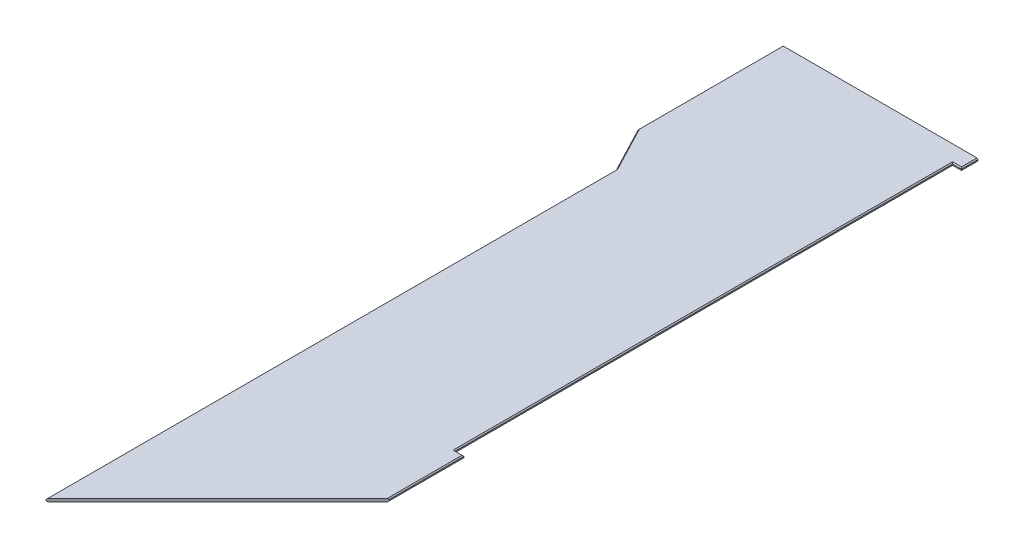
ISO-10303-21;
HEADER;
FILE_DESCRIPTION(('STEP AP214'),'2;1');
FILE_NAME('part.step','',(''),(''),'','','');
FILE_SCHEMA(('AUTOMOTIVE_DESIGN { 1 0 10303 214 1 1 1 1 }'));
ENDSEC;
DATA;
#1=APPLICATION_CONTEXT('core data for automotive mechanical design processes');
#2=APPLICATION_PROTOCOL_DEFINITION('international standard','automotive_design',2000,#1);
#3=PRODUCT_CONTEXT('',#1,'mechanical');
#4=PRODUCT('Part','Part','',(#3));
#5=PRODUCT_RELATED_PRODUCT_CATEGORY('part','',(#4));
#6=PRODUCT_DEFINITION_FORMATION('','',#4);
#7=PRODUCT_DEFINITION_CONTEXT('part definition',#1,'design');
#8=PRODUCT_DEFINITION('design','',#6,#7);
#9=PRODUCT_DEFINITION_SHAPE('','',#8);
#10=(LENGTH_UNIT() NAMED_UNIT(*) SI_UNIT(.MILLI.,.METRE.));
#11=(NAMED_UNIT(*) PLANE_ANGLE_UNIT() SI_UNIT($,.RADIAN.));
#12=(NAMED_UNIT(*) SI_UNIT($,.STERADIAN.) SOLID_ANGLE_UNIT());
#13=UNCERTAINTY_MEASURE_WITH_UNIT(LENGTH_MEASURE(1.E-05),#10,'distance_accuracy_value','');
#14=(GEOMETRIC_REPRESENTATION_CONTEXT(3) GLOBAL_UNCERTAINTY_ASSIGNED_CONTEXT((#13)) GLOBAL_UNIT_ASSIGNED_CONTEXT((#10,
#11,#12)) REPRESENTATION_CONTEXT('',''));
#15=CARTESIAN_POINT('',(0.,0.,0.));
#16=DIRECTION('',(0.,0.,1.));
#17=DIRECTION('',(1.,0.,0.));
#18=AXIS2_PLACEMENT_3D('',#15,#16,#17);
#19=CARTESIAN_POINT('',(552.551731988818,9.525,994.453846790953));
#20=DIRECTION('',(0.,0.,1.));
#21=DIRECTION('',(1.,0.,0.));
#22=AXIS2_PLACEMENT_3D('',#19,#20,#21);
#23=PLANE('',#22);
#24=DIRECTION('',(0.,-1.,0.));
#25=VECTOR('',#24,1.);
#26=CARTESIAN_POINT('',(552.551731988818,9.525,994.453846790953));
#27=LINE('',#26,#25);
#28=CARTESIAN_POINT('',(552.551731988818,3.52500000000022,994.453846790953));
#29=VERTEX_POINT('',#28);
#30=CARTESIAN_POINT('',(552.551731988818,-3.52500000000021,994.453846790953));
#31=VERTEX_POINT('',#30);
#32=EDGE_CURVE('E391',#29,#31,#27,.T.);
#33=ORIENTED_EDGE('',*,*,#32,.T.);
#34=DIRECTION('',(-1.,0.,0.));
#35=VECTOR('',#34,1.);
#36=CARTESIAN_POINT('',(498.751731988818,-3.52500000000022,994.453846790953));
#37=LINE('',#36,#35);
#38=CARTESIAN_POINT('',(498.751731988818,-3.52500000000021,994.453846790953));
#39=VERTEX_POINT('',#38);
#40=EDGE_CURVE('E327',#31,#39,#37,.T.);
#41=ORIENTED_EDGE('',*,*,#40,.T.);
#42=DIRECTION('',(0.,-1.,0.));
#43=VECTOR('',#42,1.);
#44=CARTESIAN_POINT('',(498.751731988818,9.525,994.453846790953));
#45=LINE('',#44,#43);
#46=CARTESIAN_POINT('',(498.751731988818,3.52500000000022,994.453846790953));
#47=VERTEX_POINT('',#46);
#48=EDGE_CURVE('E218',#47,#39,#45,.T.);
#49=ORIENTED_EDGE('',*,*,#48,.F.);
#50=DIRECTION('',(1.,0.,0.));
#51=VECTOR('',#50,1.);
#52=CARTESIAN_POINT('',(552.551731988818,3.52500000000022,994.453846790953));
#53=LINE('',#52,#51);
#54=EDGE_CURVE('E73',#47,#29,#53,.T.);
#55=ORIENTED_EDGE('',*,*,#54,.T.);
#56=EDGE_LOOP('',(#33,#41,#49,#55));
#57=FACE_BOUND('',#56,.T.);
#58=ADVANCED_FACE('F50',(#57),#23,.F.);
#59=CARTESIAN_POINT('',(498.751731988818,9.525,994.453846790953));
#60=DIRECTION('',(-1.,0.,0.));
#61=DIRECTION('',(0.,0.,1.));
#62=AXIS2_PLACEMENT_3D('',#59,#60,#61);
#63=PLANE('',#62);
#64=ORIENTED_EDGE('',*,*,#48,.T.);
#65=DIRECTION('',(0.,0.,-1.));
#66=VECTOR('',#65,1.);
#67=CARTESIAN_POINT('',(498.751731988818,-3.52500000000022,-2017.54615320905));
#68=LINE('',#67,#66);
#69=CARTESIAN_POINT('',(498.751731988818,-3.52500000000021,-2017.54615320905));
#70=VERTEX_POINT('',#69);
#71=EDGE_CURVE('E323',#39,#70,#68,.T.);
#72=ORIENTED_EDGE('',*,*,#71,.T.);
#73=DIRECTION('',(0.,-1.,0.));
#74=VECTOR('',#73,1.);
#75=CARTESIAN_POINT('',(498.751731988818,9.525,-2017.54615320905));
#76=LINE('',#75,#74);
#77=CARTESIAN_POINT('',(498.751731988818,3.52500000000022,-2017.54615320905));
#78=VERTEX_POINT('',#77);
#79=EDGE_CURVE('E228',#78,#70,#76,.T.);
#80=ORIENTED_EDGE('',*,*,#79,.F.);
#81=DIRECTION('',(0.,0.,1.));
#82=VECTOR('',#81,1.);
#83=CARTESIAN_POINT('',(498.751731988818,3.52500000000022,994.453846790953));
#84=LINE('',#83,#82);
#85=EDGE_CURVE('E325',#78,#47,#84,.T.);
#86=ORIENTED_EDGE('',*,*,#85,.T.);
#87=EDGE_LOOP('',(#64,#72,#80,#86));
#88=FACE_BOUND('',#87,.T.);
#89=ADVANCED_FACE('F461',(#88),#63,.F.);
#90=CARTESIAN_POINT('',(498.751731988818,9.525,-2017.54615320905));
#91=DIRECTION('',(0.,0.,-1.));
#92=DIRECTION('',(-1.,0.,0.));
#93=AXIS2_PLACEMENT_3D('',#90,#91,#92);
#94=PLANE('',#93);
#95=ORIENTED_EDGE('',*,*,#79,.T.);
#96=DIRECTION('',(1.,0.,0.));
#97=VECTOR('',#96,1.);
#98=CARTESIAN_POINT('',(552.551731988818,-3.52500000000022,-2017.54615320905));
#99=LINE('',#98,#97);
#100=CARTESIAN_POINT('',(552.551731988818,-3.52500000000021,-2017.54615320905));
#101=VERTEX_POINT('',#100);
#102=EDGE_CURVE('E316',#70,#101,#99,.T.);
#103=ORIENTED_EDGE('',*,*,#102,.T.);
#104=DIRECTION('',(0.,-1.,0.));
#105=VECTOR('',#104,1.);
#106=CARTESIAN_POINT('',(552.551731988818,9.525,-2017.54615320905));
#107=LINE('',#106,#105);
#108=CARTESIAN_POINT('',(552.551731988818,3.52500000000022,-2017.54615320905));
#109=VERTEX_POINT('',#108);
#110=EDGE_CURVE('E412',#109,#101,#107,.T.);
#111=ORIENTED_EDGE('',*,*,#110,.F.);
#112=DIRECTION('',(-1.,0.,0.));
#113=VECTOR('',#112,1.);
#114=CARTESIAN_POINT('',(498.751731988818,3.52500000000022,-2017.54615320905));
#115=LINE('',#114,#113);
#116=EDGE_CURVE('E317',#109,#78,#115,.T.);
#117=ORIENTED_EDGE('',*,*,#116,.T.);
#118=EDGE_LOOP('',(#95,#103,#111,#117));
#119=FACE_BOUND('',#118,.T.);
#120=ADVANCED_FACE('F421',(#119),#94,.F.);
#121=CARTESIAN_POINT('',(552.551731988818,9.525,-2017.54615320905));
#122=DIRECTION('',(-1.,0.,0.));
#123=DIRECTION('',(0.,0.,1.));
#124=AXIS2_PLACEMENT_3D('',#121,#122,#123);
#125=PLANE('',#124);
#126=ORIENTED_EDGE('',*,*,#110,.T.);
#127=DIRECTION('',(0.,0.,-1.));
#128=VECTOR('',#127,1.);
#129=CARTESIAN_POINT('',(552.551731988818,-3.52500000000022,-2117.54615320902));
#130=LINE('',#129,#128);
#131=CARTESIAN_POINT('',(552.551731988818,-3.52500000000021,-2117.54615320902));
#132=VERTEX_POINT('',#131);
#133=EDGE_CURVE('E315',#101,#132,#130,.T.);
#134=ORIENTED_EDGE('',*,*,#133,.T.);
#135=DIRECTION('',(0.,-1.,0.));
#136=VECTOR('',#135,1.);
#137=CARTESIAN_POINT('',(552.551731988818,9.525,-2117.54615320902));
#138=LINE('',#137,#136);
#139=CARTESIAN_POINT('',(552.551731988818,3.52500000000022,-2117.54615320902));
#140=VERTEX_POINT('',#139);
#141=EDGE_CURVE('E414',#140,#132,#138,.T.);
#142=ORIENTED_EDGE('',*,*,#141,.F.);
#143=DIRECTION('',(0.,0.,1.));
#144=VECTOR('',#143,1.);
#145=CARTESIAN_POINT('',(552.551731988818,3.52500000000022,-2017.54615320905));
#146=LINE('',#145,#144);
#147=EDGE_CURVE('E307',#140,#109,#146,.T.);
#148=ORIENTED_EDGE('',*,*,#147,.T.);
#149=EDGE_LOOP('',(#126,#134,#142,#148));
#150=FACE_BOUND('',#149,.T.);
#151=ADVANCED_FACE('F445',(#150),#125,.F.);
#152=CARTESIAN_POINT('',(552.551731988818,9.525,-2117.54615320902));
#153=DIRECTION('',(0.,0.,1.));
#154=DIRECTION('',(1.,0.,0.));
#155=AXIS2_PLACEMENT_3D('',#152,#153,#154);
#156=PLANE('',#155);
#157=DIRECTION('',(-1.,0.,0.));
#158=VECTOR('',#157,1.);
#159=CARTESIAN_POINT('',(552.551731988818,-9.525,-2117.54615320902));
#160=LINE('',#159,#158);
#161=CARTESIAN_POINT('',(546.551731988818,-9.525,-2117.54615320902));
#162=VERTEX_POINT('',#161);
#163=CARTESIAN_POINT('',(-626.248268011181,-9.525,-2117.54615320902));
#164=VERTEX_POINT('',#163);
#165=EDGE_CURVE('E341',#162,#164,#160,.T.);
#166=ORIENTED_EDGE('',*,*,#165,.T.);
#167=DIRECTION('',(-0.707106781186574,0.707106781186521,0.));
#168=VECTOR('',#167,1.);
#169=CARTESIAN_POINT('',(-632.248268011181,-3.52500000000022,-2117.54615320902));
#170=LINE('',#169,#168);
#171=CARTESIAN_POINT('',(-632.248268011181,-3.52500000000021,-2117.54615320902));
#172=VERTEX_POINT('',#171);
#173=EDGE_CURVE('E284',#164,#172,#170,.T.);
#174=ORIENTED_EDGE('',*,*,#173,.T.);
#175=DIRECTION('',(0.,-1.,0.));
#176=VECTOR('',#175,1.);
#177=CARTESIAN_POINT('',(-632.248268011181,9.525,-2117.54615320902));
#178=LINE('',#177,#176);
#179=CARTESIAN_POINT('',(-632.248268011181,3.52500000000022,-2117.54615320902));
#180=VERTEX_POINT('',#179);
#181=EDGE_CURVE('E410',#180,#172,#178,.T.);
#182=ORIENTED_EDGE('',*,*,#181,.F.);
#183=DIRECTION('',(-0.707106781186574,-0.707106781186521,0.));
#184=VECTOR('',#183,1.);
#185=CARTESIAN_POINT('',(-626.248268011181,9.525,-2117.54615320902));
#186=LINE('',#185,#184);
#187=CARTESIAN_POINT('',(-626.248268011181,9.525,-2117.54615320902));
#188=VERTEX_POINT('',#187);
#189=EDGE_CURVE('E279',#180,#188,#186,.F.);
#190=ORIENTED_EDGE('',*,*,#189,.T.);
#191=DIRECTION('',(-1.,0.,0.));
#192=VECTOR('',#191,1.);
#193=CARTESIAN_POINT('',(552.551731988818,9.525,-2117.54615320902));
#194=LINE('',#193,#192);
#195=CARTESIAN_POINT('',(546.551731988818,9.525,-2117.54615320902));
#196=VERTEX_POINT('',#195);
#197=EDGE_CURVE('E448',#196,#188,#194,.T.);
#198=ORIENTED_EDGE('',*,*,#197,.F.);
#199=DIRECTION('',(-0.707106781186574,0.707106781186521,0.));
#200=VECTOR('',#199,1.);
#201=CARTESIAN_POINT('',(546.551731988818,9.525,-2117.54615320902));
#202=LINE('',#201,#200);
#203=EDGE_CURVE('E275',#196,#140,#202,.F.);
#204=ORIENTED_EDGE('',*,*,#203,.T.);
#205=ORIENTED_EDGE('',*,*,#141,.T.);
#206=DIRECTION('',(-0.707106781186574,-0.707106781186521,0.));
#207=VECTOR('',#206,1.);
#208=CARTESIAN_POINT('',(552.551731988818,-3.52500000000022,-2117.54615320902));
#209=LINE('',#208,#207);
#210=EDGE_CURVE('E273',#132,#162,#209,.T.);
#211=ORIENTED_EDGE('',*,*,#210,.T.);
#212=EDGE_LOOP('',(#166,#174,#182,#190,#198,#204,#205,#211));
#213=FACE_BOUND('',#212,.T.);
#214=ADVANCED_FACE('F447',(#213),#156,.F.);
#215=CARTESIAN_POINT('',(-632.248268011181,9.525,-2117.54615320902));
#216=DIRECTION('',(1.,0.,0.));
#217=DIRECTION('',(0.,0.,-1.));
#218=AXIS2_PLACEMENT_3D('',#215,#216,#217);
#219=PLANE('',#218);
#220=ORIENTED_EDGE('',*,*,#181,.T.);
#221=DIRECTION('',(0.,0.,1.));
#222=VECTOR('',#221,1.);
#223=CARTESIAN_POINT('',(-632.248268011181,-3.52500000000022,-1245.01955496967));
#224=LINE('',#223,#222);
#225=CARTESIAN_POINT('',(-632.248268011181,-3.52500000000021,-1245.01955496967));
#226=VERTEX_POINT('',#225);
#227=EDGE_CURVE('E269',#172,#226,#224,.T.);
#228=ORIENTED_EDGE('',*,*,#227,.T.);
#229=DIRECTION('',(0.,-1.,0.));
#230=VECTOR('',#229,1.);
#231=CARTESIAN_POINT('',(-632.248268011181,9.525,-1245.01955496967));
#232=LINE('',#231,#230);
#233=CARTESIAN_POINT('',(-632.248268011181,3.52500000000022,-1245.01955496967));
#234=VERTEX_POINT('',#233);
#235=EDGE_CURVE('E401',#234,#226,#232,.T.);
#236=ORIENTED_EDGE('',*,*,#235,.F.);
#237=DIRECTION('',(0.,0.,-1.));
#238=VECTOR('',#237,1.);
#239=CARTESIAN_POINT('',(-632.248268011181,3.52500000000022,-2117.54615320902));
#240=LINE('',#239,#238);
#241=EDGE_CURVE('E268',#234,#180,#240,.T.);
#242=ORIENTED_EDGE('',*,*,#241,.T.);
#243=EDGE_LOOP('',(#220,#228,#236,#242));
#244=FACE_BOUND('',#243,.T.);
#245=ADVANCED_FACE('F690',(#244),#219,.F.);
#246=CARTESIAN_POINT('',(-487.06076801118,9.525,-967.229254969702));
#247=DIRECTION('',(0.886253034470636,0.,-0.463201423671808));
#248=DIRECTION('',(-0.463201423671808,0.,-0.886253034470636));
#249=AXIS2_PLACEMENT_3D('',#246,#247,#248);
#250=PLANE('',#249);
#251=ORIENTED_EDGE('',*,*,#235,.T.);
#252=DIRECTION('',(0.463201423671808,0.,0.886253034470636));
#253=VECTOR('',#252,1.);
#254=CARTESIAN_POINT('',(-487.06076801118,-3.52500000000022,-967.229254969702));
#255=LINE('',#254,#253);
#256=CARTESIAN_POINT('',(-487.06076801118,-3.52500000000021,-967.229254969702));
#257=VERTEX_POINT('',#256);
#258=EDGE_CURVE('E265',#226,#257,#255,.T.);
#259=ORIENTED_EDGE('',*,*,#258,.T.);
#260=DIRECTION('',(0.,-1.,0.));
#261=VECTOR('',#260,1.);
#262=CARTESIAN_POINT('',(-487.06076801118,9.525,-967.229254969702));
#263=LINE('',#262,#261);
#264=CARTESIAN_POINT('',(-487.06076801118,3.52500000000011,-967.229254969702));
#265=VERTEX_POINT('',#264);
#266=EDGE_CURVE('E212',#265,#257,#263,.T.);
#267=ORIENTED_EDGE('',*,*,#266,.F.);
#268=DIRECTION('',(-0.463201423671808,0.,-0.886253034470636));
#269=VECTOR('',#268,1.);
#270=CARTESIAN_POINT('',(-487.06076801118,3.52500000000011,-967.229254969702));
#271=LINE('',#270,#269);
#272=EDGE_CURVE('E258',#265,#234,#271,.T.);
#273=ORIENTED_EDGE('',*,*,#272,.T.);
#274=EDGE_LOOP('',(#251,#259,#267,#273));
#275=FACE_BOUND('',#274,.T.);
#276=ADVANCED_FACE('F679',(#275),#250,.F.);
#277=CARTESIAN_POINT('',(-487.06076801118,9.525,2485.26634679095));
#278=DIRECTION('',(1.,0.,0.));
#279=DIRECTION('',(0.,0.,-1.));
#280=AXIS2_PLACEMENT_3D('',#277,#278,#279);
#281=PLANE('',#280);
#282=ORIENTED_EDGE('',*,*,#266,.T.);
#283=DIRECTION('',(0.,0.,1.));
#284=VECTOR('',#283,1.);
#285=CARTESIAN_POINT('',(-487.06076801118,-3.52500000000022,2485.26634679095));
#286=LINE('',#285,#284);
#287=CARTESIAN_POINT('',(-487.06076801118,-3.52500000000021,2485.26634679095));
#288=VERTEX_POINT('',#287);
#289=EDGE_CURVE('E209',#257,#288,#286,.T.);
#290=ORIENTED_EDGE('',*,*,#289,.T.);
#291=DIRECTION('',(0.,-1.,0.));
#292=VECTOR('',#291,1.);
#293=CARTESIAN_POINT('',(-487.06076801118,9.525,2485.26634679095));
#294=LINE('',#293,#292);
#295=CARTESIAN_POINT('',(-487.06076801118,3.52500000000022,2485.26634679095));
#296=VERTEX_POINT('',#295);
#297=EDGE_CURVE('E192',#296,#288,#294,.T.);
#298=ORIENTED_EDGE('',*,*,#297,.F.);
#299=DIRECTION('',(0.,0.,-1.));
#300=VECTOR('',#299,1.);
#301=CARTESIAN_POINT('',(-487.06076801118,3.52500000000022,2485.26634679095));
#302=LINE('',#301,#300);
#303=EDGE_CURVE('E207',#296,#265,#302,.T.);
#304=ORIENTED_EDGE('',*,*,#303,.T.);
#305=EDGE_LOOP('',(#282,#290,#298,#304));
#306=FACE_BOUND('',#305,.T.);
#307=ADVANCED_FACE('F202',(#306),#281,.F.);
#308=CARTESIAN_POINT('',(552.551731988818,9.525,1445.65384679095));
#309=DIRECTION('',(-0.707106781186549,0.,-0.707106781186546));
#310=DIRECTION('',(-0.707106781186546,0.,0.707106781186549));
#311=AXIS2_PLACEMENT_3D('',#308,#309,#310);
#312=PLANE('',#311);
#313=ORIENTED_EDGE('',*,*,#297,.T.);
#314=DIRECTION('',(0.577350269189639,-0.577350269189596,-0.577350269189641));
#315=VECTOR('',#314,1.);
#316=CARTESIAN_POINT('',(-487.060768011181,-3.52500000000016,2485.26634679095));
#317=LINE('',#316,#315);
#318=CARTESIAN_POINT('',(-481.06076801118,-9.525,2479.26634679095));
#319=VERTEX_POINT('',#318);
#320=EDGE_CURVE('E198',#288,#319,#317,.T.);
#321=ORIENTED_EDGE('',*,*,#320,.T.);
#322=DIRECTION('',(0.707106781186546,0.,-0.707106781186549));
#323=VECTOR('',#322,1.);
#324=CARTESIAN_POINT('',(552.551731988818,-9.525,1445.65384679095));
#325=LINE('',#324,#323);
#326=CARTESIAN_POINT('',(546.551731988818,-9.525,1451.65384679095));
#327=VERTEX_POINT('',#326);
#328=EDGE_CURVE('E765',#319,#327,#325,.T.);
#329=ORIENTED_EDGE('',*,*,#328,.T.);
#330=DIRECTION('',(0.577350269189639,0.577350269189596,-0.577350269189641));
#331=VECTOR('',#330,1.);
#332=CARTESIAN_POINT('',(552.551731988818,-3.52500000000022,1445.65384679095));
#333=LINE('',#332,#331);
#334=CARTESIAN_POINT('',(552.551731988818,-3.52500000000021,1445.65384679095));
#335=VERTEX_POINT('',#334);
#336=EDGE_CURVE('E197',#327,#335,#333,.T.);
#337=ORIENTED_EDGE('',*,*,#336,.T.);
#338=DIRECTION('',(0.,-1.,0.));
#339=VECTOR('',#338,1.);
#340=CARTESIAN_POINT('',(552.551731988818,9.525,1445.65384679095));
#341=LINE('',#340,#339);
#342=CARTESIAN_POINT('',(552.551731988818,3.52500000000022,1445.65384679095));
#343=VERTEX_POINT('',#342);
#344=EDGE_CURVE('E215',#343,#335,#341,.T.);
#345=ORIENTED_EDGE('',*,*,#344,.F.);
#346=DIRECTION('',(0.577350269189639,-0.577350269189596,-0.577350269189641));
#347=VECTOR('',#346,1.);
#348=CARTESIAN_POINT('',(1030.43634758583,-474.359615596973,967.769231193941));
#349=LINE('',#348,#347);
#350=CARTESIAN_POINT('',(546.551731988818,9.525,1451.65384679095));
#351=VERTEX_POINT('',#350);
#352=EDGE_CURVE('E221',#343,#351,#349,.F.);
#353=ORIENTED_EDGE('',*,*,#352,.T.);
#354=DIRECTION('',(0.707106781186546,0.,-0.707106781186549));
#355=VECTOR('',#354,1.);
#356=CARTESIAN_POINT('',(552.551731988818,9.525,1445.65384679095));
#357=LINE('',#356,#355);
#358=CARTESIAN_POINT('',(-481.06076801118,9.525,2479.26634679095));
#359=VERTEX_POINT('',#358);
#360=EDGE_CURVE('E194',#359,#351,#357,.T.);
#361=ORIENTED_EDGE('',*,*,#360,.F.);
#362=DIRECTION('',(0.577350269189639,0.577350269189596,-0.577350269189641));
#363=VECTOR('',#362,1.);
#364=CARTESIAN_POINT('',(345.361347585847,835.947115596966,1652.84423119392));
#365=LINE('',#364,#363);
#366=EDGE_CURVE('E189',#359,#296,#365,.F.);
#367=ORIENTED_EDGE('',*,*,#366,.T.);
#368=EDGE_LOOP('',(#313,#321,#329,#337,#345,#353,#361,#367));
#369=FACE_BOUND('',#368,.T.);
#370=ADVANCED_FACE('F188',(#369),#312,.F.);
#371=CARTESIAN_POINT('',(552.551731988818,9.525,1445.65384679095));
#372=DIRECTION('',(-1.,0.,0.));
#373=DIRECTION('',(0.,0.,1.));
#374=AXIS2_PLACEMENT_3D('',#371,#372,#373);
#375=PLANE('',#374);
#376=ORIENTED_EDGE('',*,*,#344,.T.);
#377=DIRECTION('',(0.,0.,-1.));
#378=VECTOR('',#377,1.);
#379=CARTESIAN_POINT('',(552.551731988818,-3.52500000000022,994.453846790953));
#380=LINE('',#379,#378);
#381=EDGE_CURVE('E11',#335,#31,#380,.T.);
#382=ORIENTED_EDGE('',*,*,#381,.T.);
#383=ORIENTED_EDGE('',*,*,#32,.F.);
#384=DIRECTION('',(0.,0.,1.));
#385=VECTOR('',#384,1.);
#386=CARTESIAN_POINT('',(552.551731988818,3.52500000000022,1445.65384679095));
#387=LINE('',#386,#385);
#388=EDGE_CURVE('E59',#29,#343,#387,.T.);
#389=ORIENTED_EDGE('',*,*,#388,.T.);
#390=EDGE_LOOP('',(#376,#382,#383,#389));
#391=FACE_BOUND('',#390,.T.);
#392=ADVANCED_FACE('F394',(#391),#375,.F.);
#393=CARTESIAN_POINT('',(0.,9.525,0.));
#394=DIRECTION('',(0.,-1.,0.));
#395=DIRECTION('',(0.,0.,-1.));
#396=AXIS2_PLACEMENT_3D('',#393,#394,#395);
#397=PLANE('',#396);
#398=DIRECTION('',(0.463201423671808,0.,0.886253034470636));
#399=VECTOR('',#398,1.);
#400=CARTESIAN_POINT('',(19.8191740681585,9.525,-10.3585198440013));
#401=LINE('',#400,#399);
#402=CARTESIAN_POINT('',(-626.248268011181,9.525,-1246.49295673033));
#403=VERTEX_POINT('',#402);
#404=CARTESIAN_POINT('',(-481.06076801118,9.525,-968.702656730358));
#405=VERTEX_POINT('',#404);
#406=EDGE_CURVE('E303',#403,#405,#401,.T.);
#407=ORIENTED_EDGE('',*,*,#406,.T.);
#408=DIRECTION('',(0.,0.,1.));
#409=VECTOR('',#408,1.);
#410=CARTESIAN_POINT('',(-481.06076801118,9.525,0.));
#411=LINE('',#410,#409);
#412=EDGE_CURVE('E306',#405,#359,#411,.T.);
#413=ORIENTED_EDGE('',*,*,#412,.T.);
#414=ORIENTED_EDGE('',*,*,#360,.T.);
#415=DIRECTION('',(0.,0.,-1.));
#416=VECTOR('',#415,1.);
#417=CARTESIAN_POINT('',(546.551731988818,9.525,0.));
#418=LINE('',#417,#416);
#419=CARTESIAN_POINT('',(546.551731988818,9.525,1000.45384679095));
#420=VERTEX_POINT('',#419);
#421=EDGE_CURVE('E283',#351,#420,#418,.T.);
#422=ORIENTED_EDGE('',*,*,#421,.T.);
#423=DIRECTION('',(-1.,0.,0.));
#424=VECTOR('',#423,1.);
#425=CARTESIAN_POINT('',(0.,9.525,1000.45384679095));
#426=LINE('',#425,#424);
#427=CARTESIAN_POINT('',(492.751731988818,9.525,1000.45384679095));
#428=VERTEX_POINT('',#427);
#429=EDGE_CURVE('E290',#420,#428,#426,.T.);
#430=ORIENTED_EDGE('',*,*,#429,.T.);
#431=DIRECTION('',(0.,0.,-1.));
#432=VECTOR('',#431,1.);
#433=CARTESIAN_POINT('',(492.751731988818,9.525,0.));
#434=LINE('',#433,#432);
#435=CARTESIAN_POINT('',(492.751731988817,9.525,-2023.54615320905));
#436=VERTEX_POINT('',#435);
#437=EDGE_CURVE('E287',#428,#436,#434,.T.);
#438=ORIENTED_EDGE('',*,*,#437,.T.);
#439=DIRECTION('',(1.,0.,0.));
#440=VECTOR('',#439,1.);
#441=CARTESIAN_POINT('',(0.,9.525,-2023.54615320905));
#442=LINE('',#441,#440);
#443=CARTESIAN_POINT('',(546.551731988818,9.525,-2023.54615320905));
#444=VERTEX_POINT('',#443);
#445=EDGE_CURVE('E291',#436,#444,#442,.T.);
#446=ORIENTED_EDGE('',*,*,#445,.T.);
#447=DIRECTION('',(0.,0.,-1.));
#448=VECTOR('',#447,1.);
#449=CARTESIAN_POINT('',(546.551731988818,9.525,0.));
#450=LINE('',#449,#448);
#451=EDGE_CURVE('E298',#444,#196,#450,.T.);
#452=ORIENTED_EDGE('',*,*,#451,.T.);
#453=ORIENTED_EDGE('',*,*,#197,.T.);
#454=DIRECTION('',(0.,0.,1.));
#455=VECTOR('',#454,1.);
#456=CARTESIAN_POINT('',(-626.248268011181,9.525,0.));
#457=LINE('',#456,#455);
#458=EDGE_CURVE('E297',#188,#403,#457,.T.);
#459=ORIENTED_EDGE('',*,*,#458,.T.);
#460=EDGE_LOOP('',(#407,#413,#414,#422,#430,#438,#446,#452,#453,#459));
#461=FACE_BOUND('',#460,.T.);
#462=ADVANCED_FACE('F453',(#461),#397,.F.);
#463=CARTESIAN_POINT('',(0.,-9.525,0.));
#464=DIRECTION('',(0.,-1.,0.));
#465=DIRECTION('',(0.,0.,-1.));
#466=AXIS2_PLACEMENT_3D('',#463,#464,#465);
#467=PLANE('',#466);
#468=ORIENTED_EDGE('',*,*,#328,.F.);
#469=DIRECTION('',(0.,0.,-1.));
#470=VECTOR('',#469,1.);
#471=CARTESIAN_POINT('',(-481.06076801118,-9.525,-967.229254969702));
#472=LINE('',#471,#470);
#473=CARTESIAN_POINT('',(-481.06076801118,-9.525,-968.702656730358));
#474=VERTEX_POINT('',#473);
#475=EDGE_CURVE('E260',#319,#474,#472,.T.);
#476=ORIENTED_EDGE('',*,*,#475,.T.);
#477=DIRECTION('',(-0.463201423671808,0.,-0.886253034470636));
#478=VECTOR('',#477,1.);
#479=CARTESIAN_POINT('',(-626.930749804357,-9.525,-1247.79876351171));
#480=LINE('',#479,#478);
#481=CARTESIAN_POINT('',(-626.248268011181,-9.525,-1246.49295673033));
#482=VERTEX_POINT('',#481);
#483=EDGE_CURVE('E251',#474,#482,#480,.T.);
#484=ORIENTED_EDGE('',*,*,#483,.T.);
#485=DIRECTION('',(0.,0.,-1.));
#486=VECTOR('',#485,1.);
#487=CARTESIAN_POINT('',(-626.248268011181,-9.525,-2117.54615320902));
#488=LINE('',#487,#486);
#489=EDGE_CURVE('E252',#482,#164,#488,.T.);
#490=ORIENTED_EDGE('',*,*,#489,.T.);
#491=ORIENTED_EDGE('',*,*,#165,.F.);
#492=DIRECTION('',(0.,0.,1.));
#493=VECTOR('',#492,1.);
#494=CARTESIAN_POINT('',(546.551731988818,-9.525,-2017.54615320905));
#495=LINE('',#494,#493);
#496=CARTESIAN_POINT('',(546.551731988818,-9.525,-2023.54615320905));
#497=VERTEX_POINT('',#496);
#498=EDGE_CURVE('E247',#162,#497,#495,.T.);
#499=ORIENTED_EDGE('',*,*,#498,.T.);
#500=DIRECTION('',(-1.,0.,0.));
#501=VECTOR('',#500,1.);
#502=CARTESIAN_POINT('',(498.751731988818,-9.525,-2023.54615320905));
#503=LINE('',#502,#501);
#504=CARTESIAN_POINT('',(492.751731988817,-9.525,-2023.54615320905));
#505=VERTEX_POINT('',#504);
#506=EDGE_CURVE('E244',#497,#505,#503,.T.);
#507=ORIENTED_EDGE('',*,*,#506,.T.);
#508=DIRECTION('',(0.,0.,1.));
#509=VECTOR('',#508,1.);
#510=CARTESIAN_POINT('',(492.751731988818,-9.525,994.453846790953));
#511=LINE('',#510,#509);
#512=CARTESIAN_POINT('',(492.751731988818,-9.525,1000.45384679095));
#513=VERTEX_POINT('',#512);
#514=EDGE_CURVE('E245',#505,#513,#511,.T.);
#515=ORIENTED_EDGE('',*,*,#514,.T.);
#516=DIRECTION('',(1.,0.,0.));
#517=VECTOR('',#516,1.);
#518=CARTESIAN_POINT('',(552.551731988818,-9.525,1000.45384679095));
#519=LINE('',#518,#517);
#520=CARTESIAN_POINT('',(546.551731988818,-9.525,1000.45384679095));
#521=VERTEX_POINT('',#520);
#522=EDGE_CURVE('E237',#513,#521,#519,.T.);
#523=ORIENTED_EDGE('',*,*,#522,.T.);
#524=DIRECTION('',(0.,0.,1.));
#525=VECTOR('',#524,1.);
#526=CARTESIAN_POINT('',(546.551731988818,-9.525,1445.65384679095));
#527=LINE('',#526,#525);
#528=EDGE_CURVE('E236',#521,#327,#527,.T.);
#529=ORIENTED_EDGE('',*,*,#528,.T.);
#530=EDGE_LOOP('',(#468,#476,#484,#490,#491,#499,#507,#515,#523,#529));
#531=FACE_BOUND('',#530,.T.);
#532=ADVANCED_FACE('F474',(#531),#467,.T.);
#533=CARTESIAN_POINT('',(-632.248268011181,-3.52500000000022,-2117.54615320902));
#534=DIRECTION('',(-0.707106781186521,-0.707106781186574,0.));
#535=DIRECTION('',(0.,0.,-1.));
#536=AXIS2_PLACEMENT_3D('',#533,#534,#535);
#537=PLANE('',#536);
#538=ORIENTED_EDGE('',*,*,#173,.F.);
#539=ORIENTED_EDGE('',*,*,#489,.F.);
#540=DIRECTION('',(-0.696681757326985,0.696681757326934,0.17108202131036));
#541=VECTOR('',#540,1.);
#542=CARTESIAN_POINT('',(-528.252064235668,-107.521203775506,-1270.55758659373));
#543=LINE('',#542,#541);
#544=EDGE_CURVE('E339',#226,#482,#543,.F.);
#545=ORIENTED_EDGE('',*,*,#544,.F.);
#546=ORIENTED_EDGE('',*,*,#227,.F.);
#547=EDGE_LOOP('',(#538,#539,#545,#546));
#548=FACE_BOUND('',#547,.T.);
#549=ADVANCED_FACE('F512',(#548),#537,.T.);
#550=CARTESIAN_POINT('',(-487.06076801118,-3.52500000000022,-967.229254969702));
#551=DIRECTION('',(-0.626675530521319,-0.707106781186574,0.327532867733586));
#552=DIRECTION('',(-0.463201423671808,0.,-0.886253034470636));
#553=AXIS2_PLACEMENT_3D('',#550,#551,#552);
#554=PLANE('',#553);
#555=ORIENTED_EDGE('',*,*,#544,.T.);
#556=ORIENTED_EDGE('',*,*,#483,.F.);
#557=DIRECTION('',(-0.696681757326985,0.696681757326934,0.17108202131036));
#558=VECTOR('',#557,1.);
#559=CARTESIAN_POINT('',(-898.562763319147,407.976995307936,-866.177960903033));
#560=LINE('',#559,#558);
#561=EDGE_CURVE('E332',#257,#474,#560,.F.);
#562=ORIENTED_EDGE('',*,*,#561,.F.);
#563=ORIENTED_EDGE('',*,*,#258,.F.);
#564=EDGE_LOOP('',(#555,#556,#562,#563));
#565=FACE_BOUND('',#564,.T.);
#566=ADVANCED_FACE('F502',(#565),#554,.T.);
#567=CARTESIAN_POINT('',(-487.06076801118,-3.52500000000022,2485.26634679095));
#568=DIRECTION('',(-0.707106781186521,-0.707106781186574,0.));
#569=DIRECTION('',(0.,0.,-1.));
#570=AXIS2_PLACEMENT_3D('',#567,#568,#569);
#571=PLANE('',#570);
#572=ORIENTED_EDGE('',*,*,#561,.T.);
#573=ORIENTED_EDGE('',*,*,#475,.F.);
#574=ORIENTED_EDGE('',*,*,#320,.F.);
#575=ORIENTED_EDGE('',*,*,#289,.F.);
#576=EDGE_LOOP('',(#572,#573,#574,#575));
#577=FACE_BOUND('',#576,.T.);
#578=ADVANCED_FACE('F496',(#577),#571,.T.);
#579=CARTESIAN_POINT('',(-626.248268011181,9.525,0.));
#580=DIRECTION('',(0.707106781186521,-0.707106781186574,0.));
#581=DIRECTION('',(0.,0.,1.));
#582=AXIS2_PLACEMENT_3D('',#579,#580,#581);
#583=PLANE('',#582);
#584=ORIENTED_EDGE('',*,*,#189,.F.);
#585=ORIENTED_EDGE('',*,*,#241,.F.);
#586=DIRECTION('',(0.696681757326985,0.696681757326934,-0.17108202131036));
#587=VECTOR('',#586,1.);
#588=CARTESIAN_POINT('',(-774.817418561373,-139.044150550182,-1210.00928206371));
#589=LINE('',#588,#587);
#590=EDGE_CURVE('E338',#403,#234,#589,.F.);
#591=ORIENTED_EDGE('',*,*,#590,.F.);
#592=ORIENTED_EDGE('',*,*,#458,.F.);
#593=EDGE_LOOP('',(#584,#585,#591,#592));
#594=FACE_BOUND('',#593,.T.);
#595=ADVANCED_FACE('F503',(#594),#583,.F.);
#596=CARTESIAN_POINT('',(19.8191740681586,9.525,-10.3585198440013));
#597=DIRECTION('',(0.626675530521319,-0.707106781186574,-0.327532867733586));
#598=DIRECTION('',(0.463201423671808,0.,0.886253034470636));
#599=AXIS2_PLACEMENT_3D('',#596,#597,#598);
#600=PLANE('',#599);
#601=ORIENTED_EDGE('',*,*,#590,.T.);
#602=ORIENTED_EDGE('',*,*,#272,.F.);
#603=DIRECTION('',(0.696681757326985,0.696681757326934,-0.17108202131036));
#604=VECTOR('',#603,1.);
#605=CARTESIAN_POINT('',(-596.520169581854,-105.934401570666,-940.349642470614));
#606=LINE('',#605,#604);
#607=EDGE_CURVE('E216',#405,#265,#606,.F.);
#608=ORIENTED_EDGE('',*,*,#607,.F.);
#609=ORIENTED_EDGE('',*,*,#406,.F.);
#610=EDGE_LOOP('',(#601,#602,#608,#609));
#611=FACE_BOUND('',#610,.T.);
#612=ADVANCED_FACE('F481',(#611),#600,.F.);
#613=CARTESIAN_POINT('',(-481.06076801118,9.525,0.));
#614=DIRECTION('',(0.707106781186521,-0.707106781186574,0.));
#615=DIRECTION('',(0.,0.,1.));
#616=AXIS2_PLACEMENT_3D('',#613,#614,#615);
#617=PLANE('',#616);
#618=ORIENTED_EDGE('',*,*,#607,.T.);
#619=ORIENTED_EDGE('',*,*,#303,.F.);
#620=ORIENTED_EDGE('',*,*,#366,.F.);
#621=ORIENTED_EDGE('',*,*,#412,.F.);
#622=EDGE_LOOP('',(#618,#619,#620,#621));
#623=FACE_BOUND('',#622,.T.);
#624=ADVANCED_FACE('F213',(#623),#617,.F.);
#625=CARTESIAN_POINT('',(552.551731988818,-3.52500000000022,1445.65384679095));
#626=DIRECTION('',(0.707106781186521,-0.707106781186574,0.));
#627=DIRECTION('',(0.,0.,1.));
#628=AXIS2_PLACEMENT_3D('',#625,#626,#627);
#629=PLANE('',#628);
#630=ORIENTED_EDGE('',*,*,#336,.F.);
#631=ORIENTED_EDGE('',*,*,#528,.F.);
#632=DIRECTION('',(0.57735026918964,0.577350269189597,-0.57735026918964));
#633=VECTOR('',#632,1.);
#634=CARTESIAN_POINT('',(402.151731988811,-153.924999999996,1144.85384679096));
#635=LINE('',#634,#633);
#636=EDGE_CURVE('E346',#31,#521,#635,.F.);
#637=ORIENTED_EDGE('',*,*,#636,.F.);
#638=ORIENTED_EDGE('',*,*,#381,.F.);
#639=EDGE_LOOP('',(#630,#631,#637,#638));
#640=FACE_BOUND('',#639,.T.);
#641=ADVANCED_FACE('F473',(#640),#629,.T.);
#642=CARTESIAN_POINT('',(552.551731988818,-3.52500000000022,994.453846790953));
#643=DIRECTION('',(0.,-0.707106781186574,-0.707106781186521));
#644=DIRECTION('',(1.,0.,0.));
#645=AXIS2_PLACEMENT_3D('',#642,#643,#644);
#646=PLANE('',#645);
#647=ORIENTED_EDGE('',*,*,#636,.T.);
#648=ORIENTED_EDGE('',*,*,#522,.F.);
#649=DIRECTION('',(0.577350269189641,0.577350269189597,-0.577350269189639));
#650=VECTOR('',#649,1.);
#651=CARTESIAN_POINT('',(498.751731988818,-3.52500000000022,994.453846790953));
#652=LINE('',#651,#650);
#653=EDGE_CURVE('E360',#39,#513,#652,.F.);
#654=ORIENTED_EDGE('',*,*,#653,.F.);
#655=ORIENTED_EDGE('',*,*,#40,.F.);
#656=EDGE_LOOP('',(#647,#648,#654,#655));
#657=FACE_BOUND('',#656,.T.);
#658=ADVANCED_FACE('F466',(#657),#646,.T.);
#659=CARTESIAN_POINT('',(498.751731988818,-3.52500000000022,994.453846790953));
#660=DIRECTION('',(0.70710678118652,-0.707106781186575,0.));
#661=DIRECTION('',(0.,0.,1.));
#662=AXIS2_PLACEMENT_3D('',#659,#660,#661);
#663=PLANE('',#662);
#664=ORIENTED_EDGE('',*,*,#653,.T.);
#665=ORIENTED_EDGE('',*,*,#514,.F.);
#666=DIRECTION('',(0.577350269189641,0.577350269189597,0.577350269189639));
#667=VECTOR('',#666,1.);
#668=CARTESIAN_POINT('',(498.751731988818,-3.52500000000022,-2017.54615320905));
#669=LINE('',#668,#667);
#670=EDGE_CURVE('E352',#70,#505,#669,.F.);
#671=ORIENTED_EDGE('',*,*,#670,.F.);
#672=ORIENTED_EDGE('',*,*,#71,.F.);
#673=EDGE_LOOP('',(#664,#665,#671,#672));
#674=FACE_BOUND('',#673,.T.);
#675=ADVANCED_FACE('F431',(#674),#663,.T.);
#676=CARTESIAN_POINT('',(498.751731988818,-3.52500000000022,-2017.54615320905));
#677=DIRECTION('',(0.,-0.707106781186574,0.707106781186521));
#678=DIRECTION('',(-1.,0.,0.));
#679=AXIS2_PLACEMENT_3D('',#676,#677,#678);
#680=PLANE('',#679);
#681=ORIENTED_EDGE('',*,*,#670,.T.);
#682=ORIENTED_EDGE('',*,*,#506,.F.);
#683=DIRECTION('',(0.57735026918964,0.577350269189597,0.57735026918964));
#684=VECTOR('',#683,1.);
#685=CARTESIAN_POINT('',(534.618398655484,-21.4583333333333,-2035.47948654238));
#686=LINE('',#685,#684);
#687=EDGE_CURVE('E353',#101,#497,#686,.F.);
#688=ORIENTED_EDGE('',*,*,#687,.F.);
#689=ORIENTED_EDGE('',*,*,#102,.F.);
#690=EDGE_LOOP('',(#681,#682,#688,#689));
#691=FACE_BOUND('',#690,.T.);
#692=ADVANCED_FACE('F434',(#691),#680,.T.);
#693=CARTESIAN_POINT('',(552.551731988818,-3.52500000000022,-2017.54615320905));
#694=DIRECTION('',(0.707106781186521,-0.707106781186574,0.));
#695=DIRECTION('',(0.,0.,1.));
#696=AXIS2_PLACEMENT_3D('',#693,#694,#695);
#697=PLANE('',#696);
#698=ORIENTED_EDGE('',*,*,#687,.T.);
#699=ORIENTED_EDGE('',*,*,#498,.F.);
#700=ORIENTED_EDGE('',*,*,#210,.F.);
#701=ORIENTED_EDGE('',*,*,#133,.F.);
#702=EDGE_LOOP('',(#698,#699,#700,#701));
#703=FACE_BOUND('',#702,.T.);
#704=ADVANCED_FACE('F437',(#703),#697,.T.);
#705=CARTESIAN_POINT('',(546.551731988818,9.525,0.));
#706=DIRECTION('',(-0.707106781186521,-0.707106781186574,0.));
#707=DIRECTION('',(0.,0.,-1.));
#708=AXIS2_PLACEMENT_3D('',#705,#706,#707);
#709=PLANE('',#708);
#710=ORIENTED_EDGE('',*,*,#352,.F.);
#711=ORIENTED_EDGE('',*,*,#388,.F.);
#712=DIRECTION('',(-0.57735026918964,0.577350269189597,0.57735026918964));
#713=VECTOR('',#712,1.);
#714=CARTESIAN_POINT('',(880.036347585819,-323.959615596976,666.969231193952));
#715=LINE('',#714,#713);
#716=EDGE_CURVE('E55',#420,#29,#715,.F.);
#717=ORIENTED_EDGE('',*,*,#716,.F.);
#718=ORIENTED_EDGE('',*,*,#421,.F.);
#719=EDGE_LOOP('',(#710,#711,#717,#718));
#720=FACE_BOUND('',#719,.T.);
#721=ADVANCED_FACE('F49',(#720),#709,.F.);
#722=CARTESIAN_POINT('',(0.,9.525,1000.45384679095));
#723=DIRECTION('',(0.,-0.707106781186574,0.707106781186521));
#724=DIRECTION('',(-1.,0.,0.));
#725=AXIS2_PLACEMENT_3D('',#722,#723,#724);
#726=PLANE('',#725);
#727=ORIENTED_EDGE('',*,*,#716,.T.);
#728=ORIENTED_EDGE('',*,*,#54,.F.);
#729=DIRECTION('',(-0.577350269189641,0.577350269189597,0.577350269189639));
#730=VECTOR('',#729,1.);
#731=CARTESIAN_POINT('',(826.236347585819,-323.959615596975,666.969231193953));
#732=LINE('',#731,#730);
#733=EDGE_CURVE('E373',#428,#47,#732,.F.);
#734=ORIENTED_EDGE('',*,*,#733,.F.);
#735=ORIENTED_EDGE('',*,*,#429,.F.);
#736=EDGE_LOOP('',(#727,#728,#734,#735));
#737=FACE_BOUND('',#736,.T.);
#738=ADVANCED_FACE('F383',(#737),#726,.F.);
#739=CARTESIAN_POINT('',(492.751731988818,9.525,0.));
#740=DIRECTION('',(-0.70710678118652,-0.707106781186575,0.));
#741=DIRECTION('',(0.,0.,-1.));
#742=AXIS2_PLACEMENT_3D('',#739,#740,#741);
#743=PLANE('',#742);
#744=ORIENTED_EDGE('',*,*,#733,.T.);
#745=ORIENTED_EDGE('',*,*,#85,.F.);
#746=DIRECTION('',(-0.577350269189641,0.577350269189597,-0.577350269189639));
#747=VECTOR('',#746,1.);
#748=CARTESIAN_POINT('',(328.501154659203,173.775577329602,-2187.79673053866));
#749=LINE('',#748,#747);
#750=EDGE_CURVE('E369',#436,#78,#749,.F.);
#751=ORIENTED_EDGE('',*,*,#750,.F.);
#752=ORIENTED_EDGE('',*,*,#437,.F.);
#753=EDGE_LOOP('',(#744,#745,#751,#752));
#754=FACE_BOUND('',#753,.T.);
#755=ADVANCED_FACE('F465',(#754),#743,.F.);
#756=CARTESIAN_POINT('',(0.,9.525,-2023.54615320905));
#757=DIRECTION('',(0.,-0.707106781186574,-0.707106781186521));
#758=DIRECTION('',(1.,0.,0.));
#759=AXIS2_PLACEMENT_3D('',#756,#757,#758);
#760=PLANE('',#759);
#761=ORIENTED_EDGE('',*,*,#750,.T.);
#762=ORIENTED_EDGE('',*,*,#116,.F.);
#763=DIRECTION('',(-0.57735026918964,0.577350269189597,-0.57735026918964));
#764=VECTOR('',#763,1.);
#765=CARTESIAN_POINT('',(364.36782132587,191.708910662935,-2205.730063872));
#766=LINE('',#765,#764);
#767=EDGE_CURVE('E366',#444,#109,#766,.F.);
#768=ORIENTED_EDGE('',*,*,#767,.F.);
#769=ORIENTED_EDGE('',*,*,#445,.F.);
#770=EDGE_LOOP('',(#761,#762,#768,#769));
#771=FACE_BOUND('',#770,.T.);
#772=ADVANCED_FACE('F463',(#771),#760,.F.);
#773=CARTESIAN_POINT('',(546.551731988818,9.525,0.));
#774=DIRECTION('',(-0.707106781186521,-0.707106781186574,0.));
#775=DIRECTION('',(0.,0.,-1.));
#776=AXIS2_PLACEMENT_3D('',#773,#774,#775);
#777=PLANE('',#776);
#778=ORIENTED_EDGE('',*,*,#767,.T.);
#779=ORIENTED_EDGE('',*,*,#147,.F.);
#780=ORIENTED_EDGE('',*,*,#203,.F.);
#781=ORIENTED_EDGE('',*,*,#451,.F.);
#782=EDGE_LOOP('',(#778,#779,#780,#781));
#783=FACE_BOUND('',#782,.T.);
#784=ADVANCED_FACE('F454',(#783),#777,.F.);
#785=CLOSED_SHELL('',(#58,#89,#120,#151,#214,#245,#276,#307,#370,#392,#462,#532,#549,#566,#578,
#595,#612,#624,#641,#658,#675,#692,#704,#721,#738,#755,#772,#784));
#786=MANIFOLD_SOLID_BREP('B2',#785);
#787=ADVANCED_BREP_SHAPE_REPRESENTATION('',(#18,#786),#14);
#788=SHAPE_DEFINITION_REPRESENTATION(#9,#787);
ENDSEC;
END-ISO-10303-21;
